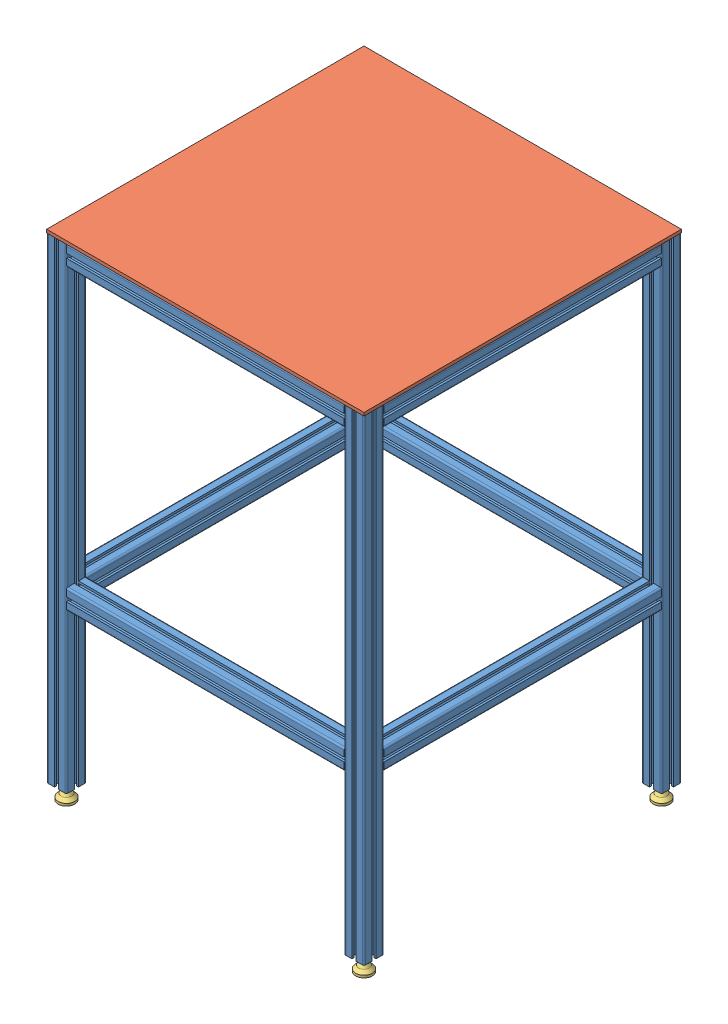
SolidWorks assembly 15-15 Table (with leveling feet).sldasm, configuration Default (file format 4700). Lengths in mm.
Overall size (609.6 948.51 609.6).
21 component instances, 3 part files, 51 mates.
Components (placement in the parent):
- 650005-2: 650005.sldprt [36] at (-590.55 -920.3944 -19.05) x (1 0 0) z (0 -1 0) size (38.1 38.1 914.4)
- 650005-3: 650005.sldprt [21] at (-571.5 -25.0444 -19.05) x (0 1 0) z (-1 0 0) size (38.1 38.1 533.4)
- 650005-4: 650005.sldprt [36] at (-19.05 -5.9944 -19.05) x (-1 0 0) z (0 1 0) size (38.1 38.1 914.4)
- 650005-5: 650005.sldprt [21] at (-19.05 -25.0444 -38.1) x (0 1 0) z (0 0 1) size (38.1 38.1 533.4)
- 650005-6: 650005.sldprt [21] at (-590.55 -25.0444 -38.1) x (0 1 0) z (0 0 1) size (38.1 38.1 533.4)
- 650005-7: 650005.sldprt [36] at (-19.05 -5.9944 -590.55) x (0 0 1) z (0 1 0) size (38.1 38.1 914.4)
- 650005-8: 650005.sldprt [36] at (-590.55 -5.9944 -590.55) x (0 0 1) z (0 1 0) size (38.1 38.1 914.4)
- 650005-9: 650005.sldprt [21] at (-38.1 -25.0444 -590.55) x (0 0 1) z (1 0 0) size (38.1 38.1 533.4)
- 650005-10: 650005.sldprt [21] at (-19.05 -596.5444 -38.1) x (-1 0 0) z (0 0 1) size (38.1 38.1 533.4)
- 650005-11: 650005.sldprt [21] at (-571.5 -596.5444 -19.05) x (0 -1 0) z (-1 0 0) size (38.1 38.1 533.4)
- 650005-12: 650005.sldprt [21] at (-590.55 -596.5444 -571.5) x (0 1 0) z (0 0 -1) size (38.1 38.1 533.4)
- 650005-13: 650005.sldprt [21] at (-38.1 -596.5444 -590.55) x (0 0 1) z (1 0 0) size (38.1 38.1 533.4)
- 655432-1: 655432.sldprt [24x24] at (0 -5.9944 -609.6) x (0 1 0) z (1 0 0) size (5.99 609.6 609.6)
- 655634-1: 655634.sldasm [Default] at (-19.05 -948.5122 -590.55) size (31.75 73.66 31.75)
  - 655634-1: 655634.SLDPRT [Default] at origin size (31.75 73.66 31.75)
- 655634-2: 655634.sldasm [Default] at (-590.55 -948.5122 -590.55) size (31.75 73.66 31.75)
  - 655634-1: 655634.SLDPRT [Default] at origin size (31.75 73.66 31.75)
- 655634-3: 655634.sldasm [Default] at (-590.55 -948.5122 -19.05) size (31.75 73.66 31.75)
  - 655634-1: 655634.SLDPRT [Default] at origin size (31.75 73.66 31.75)
- 655634-4: 655634.sldasm [Default] at (-19.05 -948.5122 -19.05) size (31.75 73.66 31.75)
  - 655634-1: 655634.SLDPRT [Default] at origin size (31.75 73.66 31.75)
Mates (geometry in assembly coordinates):
- Coincident1: coincident anti-aligned: plane of 650005-2; plane of 650005-3 through (19.05 -25.0444 -19.05) normal (-1 0 0)
- Coincident3: coincident aligned: plane of 650005-2; plane of 650005-3
- Coincident5: coincident anti-aligned: plane of 650005-2; plane of 650005-3
- Coincident7: coincident anti-aligned: plane of 650005-3 through (552.45 -25.0444 -19.05) normal (1 0 0); plane of 650005-4
- Coincident10: coincident anti-aligned: plane of 650005-3; plane of 650005-4 through (571.5 -5.9944 -19.05) normal (0 0 1)
- Coincident11: coincident aligned: plane of 650005-3 through (552.45 -5.9944 -14.986) normal (0 1 0); plane of 650005-4 through (587.502 -5.9944 -35.052) normal (0 1 0)
- Coincident12: coincident anti-aligned: plane of 650005-4; plane of 650005-5 through (571.5 -25.0444 -38.1) normal (0 0 1)
- Coincident14: coincident aligned: plane of 650005-4 through (571.5 -5.9944 -19.05) normal (0 1 0); plane of 650005-5
- Coincident16: coincident aligned: plane of 650005-4; plane of 650005-5
- Coincident17: coincident anti-aligned: plane of 650005-2 through (0 -920.3944 -38.1) normal (0 0 -1); plane of 650005-6 through (0 -25.0444 -38.1) normal (0 0 1)
- Coincident19: coincident aligned: plane of 650005-2; plane of 650005-6
- Coincident21: coincident anti-aligned: plane of 650005-2; plane of 650005-6
- Coincident23: coincident anti-aligned: plane of 650005-5 through (571.5 -25.0444 -571.5) normal (0 0 -1); plane of 650005-7
- Coincident26: coincident anti-aligned: plane of 650005-5; plane of 650005-7
- Coincident28: coincident anti-aligned: plane of 650005-6 through (0 -25.0444 -571.5) normal (0 0 -1); plane of 650005-8
- Coincident31: coincident anti-aligned: plane of 650005-6; plane of 650005-8
- Coincident32: coincident aligned: plane of 650005-5 through (567.436 -5.9944 -571.5) normal (0 1 0); plane of 650005-7 through (555.498 -5.9944 -606.552) normal (0 1 0)
- Coincident33: coincident aligned: plane of 650005-6 through (-4.064 -5.9944 -571.5) normal (0 1 0); plane of 650005-8 through (-16.002 -5.9944 -606.552) normal (0 1 0)
- Coincident34: coincident anti-aligned: plane of 650005-7; plane of 650005-9 through (552.45 -25.0444 -590.55) normal (1 0 0)
- Coincident35: coincident aligned: plane of 650005-7; plane of 650005-9
- Coincident36: coincident aligned: plane of 650005-7 through (555.498 -5.9944 -606.552) normal (0 1 0); plane of 650005-9 through (19.05 -5.9944 -586.486) normal (0 1 0)
- Coincident37: coincident anti-aligned: plane of 650005-4; plane of 650005-10 through (571.5 -596.5444 -38.1) normal (0 0 1)
- Coincident38: coincident aligned: plane of 650005-4; plane of 650005-10
- Coincident39: coincident anti-aligned: plane of 650005-2; plane of 650005-11 through (19.05 -596.5444 -19.05) normal (-1 0 0)
- Coincident40: coincident aligned: plane of 650005-2; plane of 650005-11
- Coincident41: coincident anti-aligned: plane of 650005-8; plane of 650005-12 through (0 -596.5444 -571.5) normal (0 0 -1)
- Coincident42: coincident aligned: plane of 650005-8; plane of 650005-12
- Coincident43: coincident anti-aligned: plane of 650005-7; plane of 650005-13 through (552.45 -596.5444 -590.55) normal (1 0 0)
- Coincident44: coincident aligned: plane of 650005-7; plane of 650005-13
- Distance1: distance = 304.8 mm aligned: plane of 650005-13 through (-571.5 -615.5944 -594.614) normal (0 -1 0); plane of 650005-7 through (-35.052 -920.3944 -606.552) normal (0 -1 0)
- Distance2: distance = 304.8 mm aligned: plane of 650005-10 through (-14.986 -615.5944 -571.5) normal (0 -1 0); plane of 650005-4 through (-3.048 -920.3944 -35.052) normal (0 -1 0)
- Distance3: distance = 304.8 mm aligned: plane of 650005-11 through (-38.1 -615.5944 -23.114) normal (0 -1 0); plane of 650005-2 through (-606.552 -920.3944 -35.052) normal (0 -1 0)
- Distance4: distance = 304.8 mm aligned: plane of 650005-12 through (-594.614 -615.5944 -38.1) normal (0 -1 0); plane of 650005-8 through (-606.552 -920.3944 -606.552) normal (0 -1 0)
- Coincident51: coincident anti-aligned: plane of 650005-3 through (552.45 -5.9944 -14.986) normal (0 1 0); plane of 655432-1 through (590.55 -5.9944 0) normal (0 -1 0)
- Coincident52: coincident aligned: plane of 650005-9 through (19.05 -20.9804 -609.6) normal (0 0 -1); plane of 655432-1 through (590.55 0 -609.6) normal (0 0 -1)
- Coincident53: coincident aligned: plane of 650005-5 through (590.55 -20.9804 -571.5) normal (1 0 0); plane of 655432-1 through (590.55 0 -609.6) normal (1 0 0)
- Coincident54: coincident anti-aligned: plane of 650005-7; plane of 655634-1 through (571.5 -920.3944 -590.55) normal (0 1 0)
- Coincident55: coincident anti-aligned: plane of 650005-7; line of 655634-1 through (571.5 -874.8522 -590.55) axis (0 -1 0)
- Coincident56: coincident anti-aligned: plane of 650005-7; line of 655634-1 through (571.5 -874.8522 -590.55) axis (0 -1 0)
- Coincident57: coincident anti-aligned: plane of 650005-8; plane of 655634-2 through (0 -920.3944 -590.55) normal (0 1 0)
- Coincident58: coincident anti-aligned: plane of 650005-8; line of 655634-2 through (0 -874.8522 -590.55) axis (0 -1 0)
- Coincident59: coincident anti-aligned: plane of 650005-8; line of 655634-2 through (0 -874.8522 -590.55) axis (0 -1 0)
- Coincident60: coincident anti-aligned: plane of 650005-2 through (0 -920.3944 -19.05) normal (0 -1 0); plane of 655634-3 through (0 -920.3944 -19.05) normal (0 1 0)
- Coincident61: coincident anti-aligned: plane of 650005-2; line of 655634-3 through (0 -874.8522 -19.05) axis (0 -1 0)
- Coincident62: coincident anti-aligned: plane of 650005-2; line of 655634-3 through (0 -874.8522 -19.05) axis (0 -1 0)
- Coincident63: coincident anti-aligned: plane of 650005-4; plane of 655634-4 through (571.5 -920.3944 -19.05) normal (0 1 0)
- Coincident64: coincident anti-aligned: plane of 650005-4; line of 655634-4 through (571.5 -874.8522 -19.05) axis (0 -1 0)
- Coincident65: coincident anti-aligned: plane of 650005-4 through (571.5 -5.9944 -19.05) normal (0 0 1); line of 655634-4 through (571.5 -874.8522 -19.05) axis (0 -1 0)
- Coincident66: coincident aligned: plane of 655432-1 through (0 0 0) normal (0 1 0); plane of assembly
- Coincident67: coincident aligned: plane of 650005-3 through (-38.1 -29.1084 0) normal (0 0 1); plane of assembly
- Coincident68: coincident aligned: plane of 650005-5 through (0 -29.1084 -571.5) normal (1 0 0); plane of assembly
